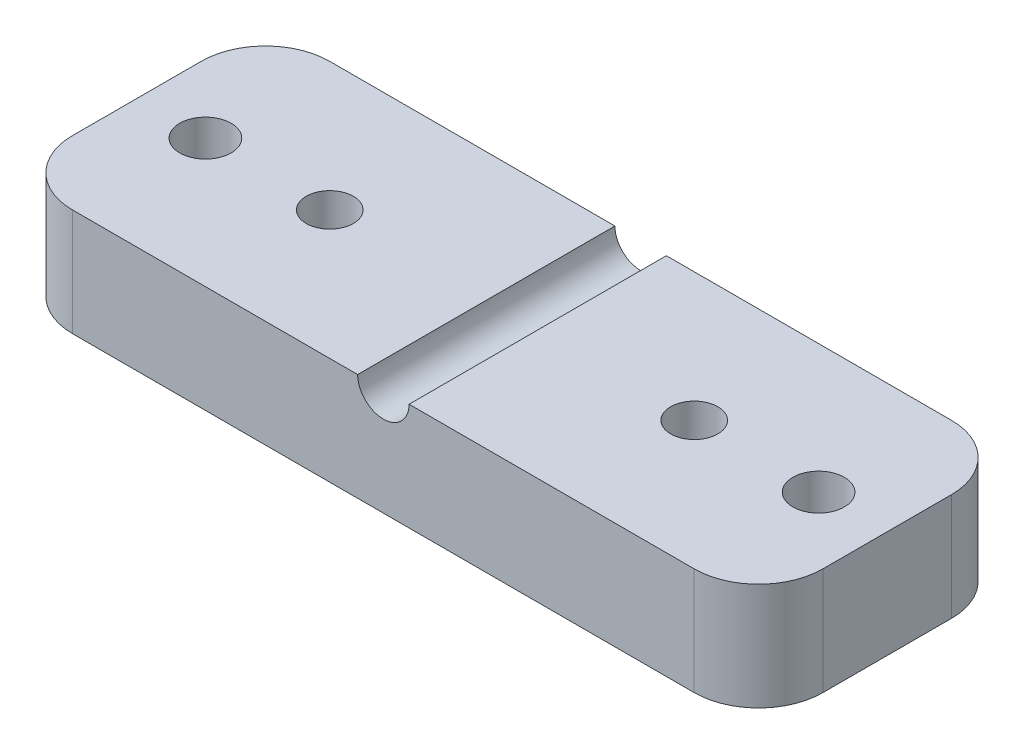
ISO-10303-21;
HEADER;
FILE_DESCRIPTION(('STEP AP214'),'2;1');
FILE_NAME('part.step','',(''),(''),'','','');
FILE_SCHEMA(('AUTOMOTIVE_DESIGN { 1 0 10303 214 1 1 1 1 }'));
ENDSEC;
DATA;
#1=APPLICATION_CONTEXT('core data for automotive mechanical design processes');
#2=APPLICATION_PROTOCOL_DEFINITION('international standard','automotive_design',2000,#1);
#3=PRODUCT_CONTEXT('',#1,'mechanical');
#4=PRODUCT('Part','Part','',(#3));
#5=PRODUCT_RELATED_PRODUCT_CATEGORY('part','',(#4));
#6=PRODUCT_DEFINITION_FORMATION('','',#4);
#7=PRODUCT_DEFINITION_CONTEXT('part definition',#1,'design');
#8=PRODUCT_DEFINITION('design','',#6,#7);
#9=PRODUCT_DEFINITION_SHAPE('','',#8);
#10=(LENGTH_UNIT() NAMED_UNIT(*) SI_UNIT(.MILLI.,.METRE.));
#11=(NAMED_UNIT(*) PLANE_ANGLE_UNIT() SI_UNIT($,.RADIAN.));
#12=(NAMED_UNIT(*) SI_UNIT($,.STERADIAN.) SOLID_ANGLE_UNIT());
#13=UNCERTAINTY_MEASURE_WITH_UNIT(LENGTH_MEASURE(1.E-05),#10,'distance_accuracy_value','');
#14=(GEOMETRIC_REPRESENTATION_CONTEXT(3) GLOBAL_UNCERTAINTY_ASSIGNED_CONTEXT((#13)) GLOBAL_UNIT_ASSIGNED_CONTEXT((#10,
#11,#12)) REPRESENTATION_CONTEXT('',''));
#15=CARTESIAN_POINT('',(0.,0.,0.));
#16=DIRECTION('',(0.,0.,1.));
#17=DIRECTION('',(1.,0.,0.));
#18=AXIS2_PLACEMENT_3D('',#15,#16,#17);
#19=CARTESIAN_POINT('',(-15.9082934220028,5.,21.1020659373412));
#20=DIRECTION('',(0.,1.,0.));
#21=DIRECTION('',(0.,0.,1.));
#22=AXIS2_PLACEMENT_3D('',#19,#20,#21);
#23=PLANE('',#22);
#24=CARTESIAN_POINT('',(-16.1082934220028,5.,18.1020659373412));
#25=DIRECTION('',(0.,1.,0.));
#26=DIRECTION('',(0.,0.,1.));
#27=AXIS2_PLACEMENT_3D('',#24,#25,#26);
#28=CIRCLE('',#27,1.2);
#29=CARTESIAN_POINT('',(-16.1082934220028,5.,19.3020659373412));
#30=VERTEX_POINT('',#29);
#31=EDGE_CURVE('E262',#30,#30,#28,.T.);
#32=ORIENTED_EDGE('',*,*,#31,.F.);
#33=EDGE_LOOP('',(#32));
#34=FACE_BOUND('',#33,.T.);
#35=CARTESIAN_POINT('',(-21.9082934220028,5.,18.1020659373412));
#36=DIRECTION('',(0.,-1.,0.));
#37=DIRECTION('',(1.,0.,0.));
#38=AXIS2_PLACEMENT_3D('',#35,#36,#37);
#39=CIRCLE('',#38,1.1);
#40=CARTESIAN_POINT('',(-20.8082934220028,5.,18.1020659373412));
#41=VERTEX_POINT('',#40);
#42=EDGE_CURVE('E252',#41,#41,#39,.T.);
#43=ORIENTED_EDGE('',*,*,#42,.T.);
#44=EDGE_LOOP('',(#43));
#45=FACE_BOUND('',#44,.T.);
#46=DIRECTION('',(0.,0.,-1.));
#47=VECTOR('',#46,1.);
#48=CARTESIAN_POINT('',(-29.2082934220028,5.,24.1020659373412));
#49=LINE('',#48,#47);
#50=CARTESIAN_POINT('',(-29.2082934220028,5.,24.1020659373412));
#51=VERTEX_POINT('',#50);
#52=CARTESIAN_POINT('',(-29.2082934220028,5.,12.1020659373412));
#53=VERTEX_POINT('',#52);
#54=EDGE_CURVE('E11',#51,#53,#49,.T.);
#55=ORIENTED_EDGE('',*,*,#54,.F.);
#56=DIRECTION('',(1.,0.,0.));
#57=VECTOR('',#56,1.);
#58=CARTESIAN_POINT('',(-44.9082934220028,5.,24.1020659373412));
#59=LINE('',#58,#57);
#60=CARTESIAN_POINT('',(-15.9082934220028,5.,24.1020659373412));
#61=VERTEX_POINT('',#60);
#62=EDGE_CURVE('E55',#51,#61,#59,.T.);
#63=ORIENTED_EDGE('',*,*,#62,.T.);
#64=CARTESIAN_POINT('',(-15.9082934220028,5.,21.1020659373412));
#65=DIRECTION('',(0.,1.,0.));
#66=DIRECTION('',(0.,0.,1.));
#67=AXIS2_PLACEMENT_3D('',#64,#65,#66);
#68=CIRCLE('',#67,3.);
#69=CARTESIAN_POINT('',(-12.9082934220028,5.,21.1020659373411));
#70=VERTEX_POINT('',#69);
#71=EDGE_CURVE('E161',#61,#70,#68,.T.);
#72=ORIENTED_EDGE('',*,*,#71,.T.);
#73=DIRECTION('',(0.,0.,-1.));
#74=VECTOR('',#73,1.);
#75=CARTESIAN_POINT('',(-12.9082934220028,5.,21.1020659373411));
#76=LINE('',#75,#74);
#77=CARTESIAN_POINT('',(-12.9082934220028,5.,15.1020659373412));
#78=VERTEX_POINT('',#77);
#79=EDGE_CURVE('E98',#70,#78,#76,.T.);
#80=ORIENTED_EDGE('',*,*,#79,.T.);
#81=CARTESIAN_POINT('',(-15.9082934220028,5.,15.1020659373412));
#82=DIRECTION('',(0.,1.,0.));
#83=DIRECTION('',(0.,0.,1.));
#84=AXIS2_PLACEMENT_3D('',#81,#82,#83);
#85=CIRCLE('',#84,3.);
#86=CARTESIAN_POINT('',(-15.9082934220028,5.,12.1020659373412));
#87=VERTEX_POINT('',#86);
#88=EDGE_CURVE('E191',#78,#87,#85,.T.);
#89=ORIENTED_EDGE('',*,*,#88,.T.);
#90=DIRECTION('',(-1.,0.,0.));
#91=VECTOR('',#90,1.);
#92=CARTESIAN_POINT('',(-15.9082934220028,5.,12.1020659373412));
#93=LINE('',#92,#91);
#94=EDGE_CURVE('E194',#87,#53,#93,.T.);
#95=ORIENTED_EDGE('',*,*,#94,.T.);
#96=EDGE_LOOP('',(#55,#63,#72,#80,#89,#95));
#97=FACE_BOUND('',#96,.T.);
#98=ADVANCED_FACE('F32',(#34,#45,#97),#23,.T.);
#99=CARTESIAN_POINT('',(-15.9082934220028,5.,21.1020659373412));
#100=DIRECTION('',(0.,-1.,0.));
#101=DIRECTION('',(0.,0.,-1.));
#102=AXIS2_PLACEMENT_3D('',#99,#100,#101);
#103=CYLINDRICAL_SURFACE('',#102,3.);
#104=CARTESIAN_POINT('',(-15.9082934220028,0.,21.1020659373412));
#105=DIRECTION('',(0.,1.,0.));
#106=DIRECTION('',(0.,0.,1.));
#107=AXIS2_PLACEMENT_3D('',#104,#105,#106);
#108=CIRCLE('',#107,3.);
#109=CARTESIAN_POINT('',(-15.9082934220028,0.,24.1020659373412));
#110=VERTEX_POINT('',#109);
#111=CARTESIAN_POINT('',(-12.9082934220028,0.,21.1020659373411));
#112=VERTEX_POINT('',#111);
#113=EDGE_CURVE('E145',#110,#112,#108,.T.);
#114=ORIENTED_EDGE('',*,*,#113,.T.);
#115=DIRECTION('',(0.,-1.,0.));
#116=VECTOR('',#115,1.);
#117=CARTESIAN_POINT('',(-12.9082934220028,5.,21.1020659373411));
#118=LINE('',#117,#116);
#119=EDGE_CURVE('E174',#70,#112,#118,.T.);
#120=ORIENTED_EDGE('',*,*,#119,.F.);
#121=ORIENTED_EDGE('',*,*,#71,.F.);
#122=DIRECTION('',(0.,-1.,0.));
#123=VECTOR('',#122,1.);
#124=CARTESIAN_POINT('',(-15.9082934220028,5.,24.1020659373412));
#125=LINE('',#124,#123);
#126=EDGE_CURVE('E144',#61,#110,#125,.T.);
#127=ORIENTED_EDGE('',*,*,#126,.T.);
#128=EDGE_LOOP('',(#114,#120,#121,#127));
#129=FACE_BOUND('',#128,.T.);
#130=ADVANCED_FACE('F34',(#129),#103,.T.);
#131=CARTESIAN_POINT('',(-12.9082934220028,5.,21.1020659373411));
#132=DIRECTION('',(-1.,0.,0.));
#133=DIRECTION('',(0.,0.,1.));
#134=AXIS2_PLACEMENT_3D('',#131,#132,#133);
#135=PLANE('',#134);
#136=DIRECTION('',(0.,0.,-1.));
#137=VECTOR('',#136,1.);
#138=CARTESIAN_POINT('',(-12.9082934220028,0.,21.1020659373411));
#139=LINE('',#138,#137);
#140=CARTESIAN_POINT('',(-12.9082934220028,0.,15.1020659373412));
#141=VERTEX_POINT('',#140);
#142=EDGE_CURVE('E148',#112,#141,#139,.T.);
#143=ORIENTED_EDGE('',*,*,#142,.T.);
#144=DIRECTION('',(0.,-1.,0.));
#145=VECTOR('',#144,1.);
#146=CARTESIAN_POINT('',(-12.9082934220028,5.,15.1020659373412));
#147=LINE('',#146,#145);
#148=EDGE_CURVE('E171',#78,#141,#147,.T.);
#149=ORIENTED_EDGE('',*,*,#148,.F.);
#150=ORIENTED_EDGE('',*,*,#79,.F.);
#151=ORIENTED_EDGE('',*,*,#119,.T.);
#152=EDGE_LOOP('',(#143,#149,#150,#151));
#153=FACE_BOUND('',#152,.T.);
#154=ADVANCED_FACE('F213',(#153),#135,.F.);
#155=CARTESIAN_POINT('',(-15.9082934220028,5.,15.1020659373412));
#156=DIRECTION('',(0.,-1.,0.));
#157=DIRECTION('',(0.,0.,-1.));
#158=AXIS2_PLACEMENT_3D('',#155,#156,#157);
#159=CYLINDRICAL_SURFACE('',#158,3.);
#160=CARTESIAN_POINT('',(-15.9082934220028,0.,15.1020659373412));
#161=DIRECTION('',(0.,1.,0.));
#162=DIRECTION('',(0.,0.,1.));
#163=AXIS2_PLACEMENT_3D('',#160,#161,#162);
#164=CIRCLE('',#163,3.);
#165=CARTESIAN_POINT('',(-15.9082934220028,0.,12.1020659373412));
#166=VERTEX_POINT('',#165);
#167=EDGE_CURVE('E151',#141,#166,#164,.T.);
#168=ORIENTED_EDGE('',*,*,#167,.T.);
#169=DIRECTION('',(0.,-1.,0.));
#170=VECTOR('',#169,1.);
#171=CARTESIAN_POINT('',(-15.9082934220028,5.,12.1020659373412));
#172=LINE('',#171,#170);
#173=EDGE_CURVE('E168',#87,#166,#172,.T.);
#174=ORIENTED_EDGE('',*,*,#173,.F.);
#175=ORIENTED_EDGE('',*,*,#88,.F.);
#176=ORIENTED_EDGE('',*,*,#148,.T.);
#177=EDGE_LOOP('',(#168,#174,#175,#176));
#178=FACE_BOUND('',#177,.T.);
#179=ADVANCED_FACE('F215',(#178),#159,.T.);
#180=CARTESIAN_POINT('',(-15.9082934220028,5.,12.1020659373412));
#181=DIRECTION('',(0.,0.,1.));
#182=DIRECTION('',(1.,0.,0.));
#183=AXIS2_PLACEMENT_3D('',#180,#181,#182);
#184=PLANE('',#183);
#185=CARTESIAN_POINT('',(-31.6082934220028,5.,12.1020659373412));
#186=VERTEX_POINT('',#185);
#187=CARTESIAN_POINT('',(-44.9082934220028,5.,12.1020659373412));
#188=VERTEX_POINT('',#187);
#189=EDGE_CURVE('E193',#186,#188,#93,.T.);
#190=ORIENTED_EDGE('',*,*,#189,.F.);
#191=CARTESIAN_POINT('',(-30.4082934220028,5.,12.1020659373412));
#192=DIRECTION('',(0.,0.,-1.));
#193=DIRECTION('',(-1.,0.,0.));
#194=AXIS2_PLACEMENT_3D('',#191,#192,#193);
#195=CIRCLE('',#194,1.2);
#196=EDGE_CURVE('E46',#53,#186,#195,.T.);
#197=ORIENTED_EDGE('',*,*,#196,.F.);
#198=ORIENTED_EDGE('',*,*,#94,.F.);
#199=ORIENTED_EDGE('',*,*,#173,.T.);
#200=DIRECTION('',(-1.,0.,0.));
#201=VECTOR('',#200,1.);
#202=CARTESIAN_POINT('',(-15.9082934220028,0.,12.1020659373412));
#203=LINE('',#202,#201);
#204=CARTESIAN_POINT('',(-44.9082934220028,0.,12.1020659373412));
#205=VERTEX_POINT('',#204);
#206=EDGE_CURVE('E153',#166,#205,#203,.T.);
#207=ORIENTED_EDGE('',*,*,#206,.T.);
#208=DIRECTION('',(0.,-1.,0.));
#209=VECTOR('',#208,1.);
#210=CARTESIAN_POINT('',(-44.9082934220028,5.,12.1020659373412));
#211=LINE('',#210,#209);
#212=EDGE_CURVE('E165',#188,#205,#211,.T.);
#213=ORIENTED_EDGE('',*,*,#212,.F.);
#214=EDGE_LOOP('',(#190,#197,#198,#199,#207,#213));
#215=FACE_BOUND('',#214,.T.);
#216=ADVANCED_FACE('F199',(#215),#184,.F.);
#217=CARTESIAN_POINT('',(-44.9082934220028,5.,15.1020659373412));
#218=DIRECTION('',(0.,-1.,0.));
#219=DIRECTION('',(0.,0.,-1.));
#220=AXIS2_PLACEMENT_3D('',#217,#218,#219);
#221=CYLINDRICAL_SURFACE('',#220,3.);
#222=CARTESIAN_POINT('',(-44.9082934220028,0.,15.1020659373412));
#223=DIRECTION('',(0.,1.,0.));
#224=DIRECTION('',(0.,0.,-1.));
#225=AXIS2_PLACEMENT_3D('',#222,#223,#224);
#226=CIRCLE('',#225,3.);
#227=CARTESIAN_POINT('',(-47.9082934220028,0.,15.1020659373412));
#228=VERTEX_POINT('',#227);
#229=EDGE_CURVE('E155',#205,#228,#226,.T.);
#230=ORIENTED_EDGE('',*,*,#229,.T.);
#231=DIRECTION('',(0.,-1.,0.));
#232=VECTOR('',#231,1.);
#233=CARTESIAN_POINT('',(-47.9082934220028,5.,15.1020659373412));
#234=LINE('',#233,#232);
#235=CARTESIAN_POINT('',(-47.9082934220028,5.,15.1020659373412));
#236=VERTEX_POINT('',#235);
#237=EDGE_CURVE('E134',#236,#228,#234,.T.);
#238=ORIENTED_EDGE('',*,*,#237,.F.);
#239=CARTESIAN_POINT('',(-44.9082934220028,5.,15.1020659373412));
#240=DIRECTION('',(0.,1.,0.));
#241=DIRECTION('',(0.,0.,-1.));
#242=AXIS2_PLACEMENT_3D('',#239,#240,#241);
#243=CIRCLE('',#242,3.);
#244=EDGE_CURVE('E122',#188,#236,#243,.T.);
#245=ORIENTED_EDGE('',*,*,#244,.F.);
#246=ORIENTED_EDGE('',*,*,#212,.T.);
#247=EDGE_LOOP('',(#230,#238,#245,#246));
#248=FACE_BOUND('',#247,.T.);
#249=ADVANCED_FACE('F203',(#248),#221,.T.);
#250=CARTESIAN_POINT('',(-47.9082934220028,5.,21.1020659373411));
#251=DIRECTION('',(1.,0.,0.));
#252=DIRECTION('',(0.,0.,-1.));
#253=AXIS2_PLACEMENT_3D('',#250,#251,#252);
#254=PLANE('',#253);
#255=DIRECTION('',(0.,0.,1.));
#256=VECTOR('',#255,1.);
#257=CARTESIAN_POINT('',(-47.9082934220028,0.,21.1020659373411));
#258=LINE('',#257,#256);
#259=CARTESIAN_POINT('',(-47.9082934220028,0.,21.1020659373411));
#260=VERTEX_POINT('',#259);
#261=EDGE_CURVE('E131',#228,#260,#258,.T.);
#262=ORIENTED_EDGE('',*,*,#261,.T.);
#263=DIRECTION('',(0.,-1.,0.));
#264=VECTOR('',#263,1.);
#265=CARTESIAN_POINT('',(-47.9082934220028,5.,21.1020659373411));
#266=LINE('',#265,#264);
#267=CARTESIAN_POINT('',(-47.9082934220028,5.,21.1020659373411));
#268=VERTEX_POINT('',#267);
#269=EDGE_CURVE('E128',#268,#260,#266,.T.);
#270=ORIENTED_EDGE('',*,*,#269,.F.);
#271=DIRECTION('',(0.,0.,1.));
#272=VECTOR('',#271,1.);
#273=CARTESIAN_POINT('',(-47.9082934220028,5.,21.1020659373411));
#274=LINE('',#273,#272);
#275=EDGE_CURVE('E114',#236,#268,#274,.T.);
#276=ORIENTED_EDGE('',*,*,#275,.F.);
#277=ORIENTED_EDGE('',*,*,#237,.T.);
#278=EDGE_LOOP('',(#262,#270,#276,#277));
#279=FACE_BOUND('',#278,.T.);
#280=ADVANCED_FACE('F129',(#279),#254,.F.);
#281=CARTESIAN_POINT('',(-44.9082934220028,5.,21.1020659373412));
#282=DIRECTION('',(0.,-1.,0.));
#283=DIRECTION('',(0.,0.,-1.));
#284=AXIS2_PLACEMENT_3D('',#281,#282,#283);
#285=CYLINDRICAL_SURFACE('',#284,3.);
#286=CARTESIAN_POINT('',(-44.9082934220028,0.,21.1020659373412));
#287=DIRECTION('',(0.,1.,0.));
#288=DIRECTION('',(0.,0.,1.));
#289=AXIS2_PLACEMENT_3D('',#286,#287,#288);
#290=CIRCLE('',#289,3.);
#291=CARTESIAN_POINT('',(-44.9082934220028,0.,24.1020659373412));
#292=VERTEX_POINT('',#291);
#293=EDGE_CURVE('E158',#260,#292,#290,.T.);
#294=ORIENTED_EDGE('',*,*,#293,.T.);
#295=DIRECTION('',(0.,-1.,0.));
#296=VECTOR('',#295,1.);
#297=CARTESIAN_POINT('',(-44.9082934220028,5.,24.1020659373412));
#298=LINE('',#297,#296);
#299=CARTESIAN_POINT('',(-44.9082934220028,5.,24.1020659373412));
#300=VERTEX_POINT('',#299);
#301=EDGE_CURVE('E135',#300,#292,#298,.T.);
#302=ORIENTED_EDGE('',*,*,#301,.F.);
#303=CARTESIAN_POINT('',(-44.9082934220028,5.,21.1020659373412));
#304=DIRECTION('',(0.,1.,0.));
#305=DIRECTION('',(0.,0.,1.));
#306=AXIS2_PLACEMENT_3D('',#303,#304,#305);
#307=CIRCLE('',#306,3.);
#308=EDGE_CURVE('E119',#268,#300,#307,.T.);
#309=ORIENTED_EDGE('',*,*,#308,.F.);
#310=ORIENTED_EDGE('',*,*,#269,.T.);
#311=EDGE_LOOP('',(#294,#302,#309,#310));
#312=FACE_BOUND('',#311,.T.);
#313=ADVANCED_FACE('F137',(#312),#285,.T.);
#314=CARTESIAN_POINT('',(-44.9082934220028,5.,24.1020659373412));
#315=DIRECTION('',(0.,0.,-1.));
#316=DIRECTION('',(-1.,0.,0.));
#317=AXIS2_PLACEMENT_3D('',#314,#315,#316);
#318=PLANE('',#317);
#319=ORIENTED_EDGE('',*,*,#62,.F.);
#320=CARTESIAN_POINT('',(-30.4082934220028,5.,24.1020659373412));
#321=DIRECTION('',(0.,0.,-1.));
#322=DIRECTION('',(-1.,0.,0.));
#323=AXIS2_PLACEMENT_3D('',#320,#321,#322);
#324=CIRCLE('',#323,1.2);
#325=CARTESIAN_POINT('',(-31.6082934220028,5.,24.1020659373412));
#326=VERTEX_POINT('',#325);
#327=EDGE_CURVE('E149',#51,#326,#324,.T.);
#328=ORIENTED_EDGE('',*,*,#327,.T.);
#329=EDGE_CURVE('E140',#300,#326,#59,.T.);
#330=ORIENTED_EDGE('',*,*,#329,.F.);
#331=ORIENTED_EDGE('',*,*,#301,.T.);
#332=DIRECTION('',(1.,0.,0.));
#333=VECTOR('',#332,1.);
#334=CARTESIAN_POINT('',(-44.9082934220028,0.,24.1020659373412));
#335=LINE('',#334,#333);
#336=EDGE_CURVE('E89',#292,#110,#335,.T.);
#337=ORIENTED_EDGE('',*,*,#336,.T.);
#338=ORIENTED_EDGE('',*,*,#126,.F.);
#339=EDGE_LOOP('',(#319,#328,#330,#331,#337,#338));
#340=FACE_BOUND('',#339,.T.);
#341=ADVANCED_FACE('F181',(#340),#318,.F.);
#342=CARTESIAN_POINT('',(-44.7082934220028,5.,18.1020659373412));
#343=DIRECTION('',(0.,1.,0.));
#344=DIRECTION('',(0.,0.,1.));
#345=AXIS2_PLACEMENT_3D('',#342,#343,#344);
#346=CIRCLE('',#345,1.2);
#347=CARTESIAN_POINT('',(-44.7082934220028,5.,19.3020659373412));
#348=VERTEX_POINT('',#347);
#349=EDGE_CURVE('E245',#348,#348,#346,.T.);
#350=ORIENTED_EDGE('',*,*,#349,.F.);
#351=EDGE_LOOP('',(#350));
#352=FACE_BOUND('',#351,.T.);
#353=CARTESIAN_POINT('',(-38.9082934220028,5.,18.1020659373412));
#354=DIRECTION('',(0.,-1.,0.));
#355=DIRECTION('',(1.,0.,0.));
#356=AXIS2_PLACEMENT_3D('',#353,#354,#355);
#357=CIRCLE('',#356,1.1);
#358=CARTESIAN_POINT('',(-37.8082934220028,5.,18.1020659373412));
#359=VERTEX_POINT('',#358);
#360=EDGE_CURVE('E183',#359,#359,#357,.T.);
#361=ORIENTED_EDGE('',*,*,#360,.T.);
#362=EDGE_LOOP('',(#361));
#363=FACE_BOUND('',#362,.T.);
#364=DIRECTION('',(0.,0.,-1.));
#365=VECTOR('',#364,1.);
#366=CARTESIAN_POINT('',(-31.6082934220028,5.,24.1020659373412));
#367=LINE('',#366,#365);
#368=EDGE_CURVE('E40',#186,#326,#367,.F.);
#369=ORIENTED_EDGE('',*,*,#368,.F.);
#370=ORIENTED_EDGE('',*,*,#189,.T.);
#371=ORIENTED_EDGE('',*,*,#244,.T.);
#372=ORIENTED_EDGE('',*,*,#275,.T.);
#373=ORIENTED_EDGE('',*,*,#308,.T.);
#374=ORIENTED_EDGE('',*,*,#329,.T.);
#375=EDGE_LOOP('',(#369,#370,#371,#372,#373,#374));
#376=FACE_BOUND('',#375,.T.);
#377=ADVANCED_FACE('F116',(#352,#363,#376),#23,.T.);
#378=CARTESIAN_POINT('',(-15.9082934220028,0.,21.1020659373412));
#379=DIRECTION('',(0.,1.,0.));
#380=DIRECTION('',(0.,0.,1.));
#381=AXIS2_PLACEMENT_3D('',#378,#379,#380);
#382=PLANE('',#381);
#383=CARTESIAN_POINT('',(-16.1082934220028,0.,18.1020659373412));
#384=DIRECTION('',(0.,1.,0.));
#385=DIRECTION('',(0.,0.,1.));
#386=AXIS2_PLACEMENT_3D('',#383,#384,#385);
#387=CIRCLE('',#386,1.2);
#388=CARTESIAN_POINT('',(-16.1082934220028,0.,19.3020659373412));
#389=VERTEX_POINT('',#388);
#390=EDGE_CURVE('E259',#389,#389,#387,.T.);
#391=ORIENTED_EDGE('',*,*,#390,.T.);
#392=EDGE_LOOP('',(#391));
#393=FACE_BOUND('',#392,.T.);
#394=CARTESIAN_POINT('',(-44.7082934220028,0.,18.1020659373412));
#395=DIRECTION('',(0.,1.,0.));
#396=DIRECTION('',(0.,0.,1.));
#397=AXIS2_PLACEMENT_3D('',#394,#395,#396);
#398=CIRCLE('',#397,1.2);
#399=CARTESIAN_POINT('',(-44.7082934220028,0.,19.3020659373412));
#400=VERTEX_POINT('',#399);
#401=EDGE_CURVE('E255',#400,#400,#398,.T.);
#402=ORIENTED_EDGE('',*,*,#401,.T.);
#403=EDGE_LOOP('',(#402));
#404=FACE_BOUND('',#403,.T.);
#405=CARTESIAN_POINT('',(-21.9082934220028,0.,18.1020659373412));
#406=DIRECTION('',(0.,-1.,0.));
#407=DIRECTION('',(1.,0.,0.));
#408=AXIS2_PLACEMENT_3D('',#405,#406,#407);
#409=CIRCLE('',#408,1.1);
#410=CARTESIAN_POINT('',(-20.8082934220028,0.,18.1020659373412));
#411=VERTEX_POINT('',#410);
#412=EDGE_CURVE('E250',#411,#411,#409,.T.);
#413=ORIENTED_EDGE('',*,*,#412,.F.);
#414=EDGE_LOOP('',(#413));
#415=FACE_BOUND('',#414,.T.);
#416=CARTESIAN_POINT('',(-38.9082934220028,0.,18.1020659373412));
#417=DIRECTION('',(0.,-1.,0.));
#418=DIRECTION('',(1.,0.,0.));
#419=AXIS2_PLACEMENT_3D('',#416,#417,#418);
#420=CIRCLE('',#419,1.1);
#421=CARTESIAN_POINT('',(-37.8082934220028,0.,18.1020659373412));
#422=VERTEX_POINT('',#421);
#423=EDGE_CURVE('E186',#422,#422,#420,.T.);
#424=ORIENTED_EDGE('',*,*,#423,.F.);
#425=EDGE_LOOP('',(#424));
#426=FACE_BOUND('',#425,.T.);
#427=ORIENTED_EDGE('',*,*,#113,.F.);
#428=ORIENTED_EDGE('',*,*,#336,.F.);
#429=ORIENTED_EDGE('',*,*,#293,.F.);
#430=ORIENTED_EDGE('',*,*,#261,.F.);
#431=ORIENTED_EDGE('',*,*,#229,.F.);
#432=ORIENTED_EDGE('',*,*,#206,.F.);
#433=ORIENTED_EDGE('',*,*,#167,.F.);
#434=ORIENTED_EDGE('',*,*,#142,.F.);
#435=EDGE_LOOP('',(#427,#428,#429,#430,#431,#432,#433,#434));
#436=FACE_BOUND('',#435,.T.);
#437=ADVANCED_FACE('F206',(#393,#404,#415,#426,#436),#382,.F.);
#438=CARTESIAN_POINT('',(-30.4082934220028,5.,24.1020659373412));
#439=DIRECTION('',(0.,0.,-1.));
#440=DIRECTION('',(-1.,0.,0.));
#441=AXIS2_PLACEMENT_3D('',#438,#439,#440);
#442=CYLINDRICAL_SURFACE('',#441,1.2);
#443=ORIENTED_EDGE('',*,*,#54,.T.);
#444=ORIENTED_EDGE('',*,*,#196,.T.);
#445=ORIENTED_EDGE('',*,*,#368,.T.);
#446=ORIENTED_EDGE('',*,*,#327,.F.);
#447=EDGE_LOOP('',(#443,#444,#445,#446));
#448=FACE_BOUND('',#447,.T.);
#449=ADVANCED_FACE('F178',(#448),#442,.F.);
#450=CARTESIAN_POINT('',(-38.9082934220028,5.,18.1020659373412));
#451=DIRECTION('',(0.,-1.,0.));
#452=DIRECTION('',(0.,0.,-1.));
#453=AXIS2_PLACEMENT_3D('',#450,#451,#452);
#454=CYLINDRICAL_SURFACE('',#453,1.1);
#455=ORIENTED_EDGE('',*,*,#360,.F.);
#456=EDGE_LOOP('',(#455));
#457=FACE_BOUND('',#456,.T.);
#458=ORIENTED_EDGE('',*,*,#423,.T.);
#459=EDGE_LOOP('',(#458));
#460=FACE_BOUND('',#459,.T.);
#461=ADVANCED_FACE('F283',(#457,#460),#454,.F.);
#462=CARTESIAN_POINT('',(-21.9082934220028,5.,18.1020659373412));
#463=DIRECTION('',(0.,-1.,0.));
#464=DIRECTION('',(0.,0.,-1.));
#465=AXIS2_PLACEMENT_3D('',#462,#463,#464);
#466=CYLINDRICAL_SURFACE('',#465,1.1);
#467=ORIENTED_EDGE('',*,*,#42,.F.);
#468=EDGE_LOOP('',(#467));
#469=FACE_BOUND('',#468,.T.);
#470=ORIENTED_EDGE('',*,*,#412,.T.);
#471=EDGE_LOOP('',(#470));
#472=FACE_BOUND('',#471,.T.);
#473=ADVANCED_FACE('F277',(#469,#472),#466,.F.);
#474=CARTESIAN_POINT('',(-44.7082934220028,0.,18.1020659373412));
#475=DIRECTION('',(0.,1.,0.));
#476=DIRECTION('',(0.,0.,1.));
#477=AXIS2_PLACEMENT_3D('',#474,#475,#476);
#478=CYLINDRICAL_SURFACE('',#477,1.2);
#479=ORIENTED_EDGE('',*,*,#401,.F.);
#480=EDGE_LOOP('',(#479));
#481=FACE_BOUND('',#480,.T.);
#482=ORIENTED_EDGE('',*,*,#349,.T.);
#483=EDGE_LOOP('',(#482));
#484=FACE_BOUND('',#483,.T.);
#485=ADVANCED_FACE('F272',(#481,#484),#478,.F.);
#486=CARTESIAN_POINT('',(-16.1082934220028,0.,18.1020659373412));
#487=DIRECTION('',(0.,1.,0.));
#488=DIRECTION('',(0.,0.,1.));
#489=AXIS2_PLACEMENT_3D('',#486,#487,#488);
#490=CYLINDRICAL_SURFACE('',#489,1.2);
#491=ORIENTED_EDGE('',*,*,#390,.F.);
#492=EDGE_LOOP('',(#491));
#493=FACE_BOUND('',#492,.T.);
#494=ORIENTED_EDGE('',*,*,#31,.T.);
#495=EDGE_LOOP('',(#494));
#496=FACE_BOUND('',#495,.T.);
#497=ADVANCED_FACE('F269',(#493,#496),#490,.F.);
#498=CLOSED_SHELL('',(#98,#130,#154,#179,#216,#249,#280,#313,#341,#377,#437,#449,#461,#473,#485,#497));
#499=MANIFOLD_SOLID_BREP('B2',#498);
#500=ADVANCED_BREP_SHAPE_REPRESENTATION('',(#18,#499),#14);
#501=SHAPE_DEFINITION_REPRESENTATION(#9,#500);
ENDSEC;
END-ISO-10303-21;
